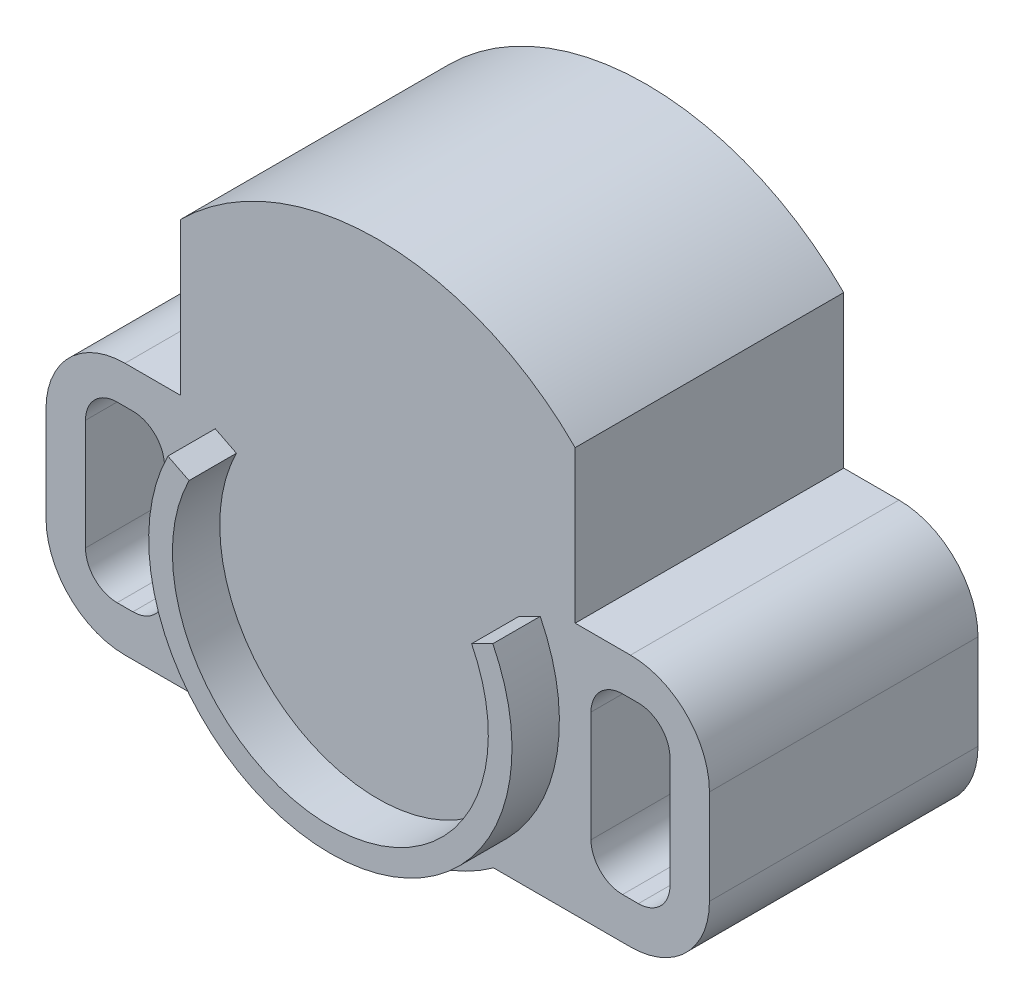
from build123d import *

# Parameters (mm, degrees)
BASE_EXTRUSION_DEPTH    = 17
ENL_V_MAT_EXTRU_1_DEPTH = 17
ESQUISSE3_R             = 11.5
BOSS_EXTRU_1_DEPTH      = 3
ESQUISSE4_R             = 10
ENL_V_MAT_EXTRU_2_DEPTH = 3
ENL_V_MAT_EXTRU_3_DEPTH = 3


with BuildPart() as part:
    # Esquisse1 → Base-Extrusion (new body)
    with BuildSketch(Plane.XY):
        with BuildLine():
            Line((-16, -10.124371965), (-7.331240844, -10.124371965))
            ThreePointArc((-7.331240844, -10.124371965), (0, -12.5), (7.331240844, -10.124371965))
            Line((7.331240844, -10.124371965), (16, -10.124371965))
            ThreePointArc((16, -10.124371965), (19.535533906, -8.659905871), (21, -5.124371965))
            Line((21, -5.124371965), (21, 0.875628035))
            ThreePointArc((21, 0.875628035), (19.535533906, 4.411161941), (16, 5.875628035))
            Line((16, 5.875628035), (12.5, 5.875628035))
            Line((12.5, 5.875628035), (12.5, 15.5))
            ThreePointArc((12.5, 15.5), (0, 20.67766953), (-12.5, 15.5))
            Line((-12.5, 15.5), (-12.5, 5.875628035))
            Line((-12.5, 5.875628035), (-16, 5.875628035))
            ThreePointArc((-16, 5.875628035), (-19.535533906, 4.411161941), (-21, 0.875628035))
            Line((-21, 0.875628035), (-21, -5.124371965))
            ThreePointArc((-21, -5.124371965), (-19.535533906, -8.659905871), (-16, -10.124371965))
        make_face()
    extrude(amount=BASE_EXTRUSION_DEPTH)

    # Esquisse2 → Enl_v. mat.-Extru.1 (cut)
    with BuildSketch(Plane.XY.offset(17)):
        with BuildLine():
            Line((-16.5, 3.5), (-15.5, 3.5))
            ThreePointArc((-15.5, 3.5), (-14.085786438, 2.914213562), (-13.5, 1.5))
            Line((-13.5, 1.5), (-13.5, -5.5))
            ThreePointArc((-13.5, -5.5), (-14.085786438, -6.914213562), (-15.5, -7.5))
            Line((-15.5, -7.5), (-16.5, -7.5))
            ThreePointArc((-16.5, -7.5), (-17.914213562, -6.914213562), (-18.5, -5.5))
            Line((-18.5, -5.5), (-18.5, 1.5))
            ThreePointArc((-18.5, 1.5), (-17.914213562, 2.914213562), (-16.5, 3.5))
        make_face()
        with BuildLine():
            Line((15.5, 3.5), (16.5, 3.5))
            ThreePointArc((16.5, 3.5), (17.914213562, 2.914213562), (18.5, 1.5))
            Line((18.5, 1.5), (18.5, -5.5))
            ThreePointArc((18.5, -5.5), (17.914213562, -6.914213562), (16.5, -7.5))
            Line((16.5, -7.5), (15.5, -7.5))
            ThreePointArc((15.5, -7.5), (14.085786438, -6.914213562), (13.5, -5.5))
            Line((13.5, -5.5), (13.5, 1.5))
            ThreePointArc((13.5, 1.5), (14.085786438, 2.914213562), (15.5, 3.5))
        make_face()
    extrude(amount=-ENL_V_MAT_EXTRU_1_DEPTH, mode=Mode.SUBTRACT)

    # Esquisse3 → Boss.-Extru.1 (add)
    with BuildSketch(Plane.XY.offset(17)):
        Circle(ESQUISSE3_R)
    extrude(amount=BOSS_EXTRU_1_DEPTH)

    # Esquisse4 → Enl_v. mat.-Extru.2 (cut)
    with BuildSketch(Plane.XY.offset(20)):
        Circle(ESQUISSE4_R)
    extrude(amount=-ENL_V_MAT_EXTRU_2_DEPTH, mode=Mode.SUBTRACT)

    # Esquisse5 → Enl_v. mat.-Extru.3 (cut)
    with BuildSketch(Plane.XY.offset(20)):
        with BuildLine():
            Line((-20, 10), (0, 0))
            Line((0, 0), (20, 10))
            ThreePointArc((20, 10), (0, 22.360679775), (-20, 10))
        make_face()
    extrude(amount=-ENL_V_MAT_EXTRU_3_DEPTH, mode=Mode.SUBTRACT)


solid = part.part
